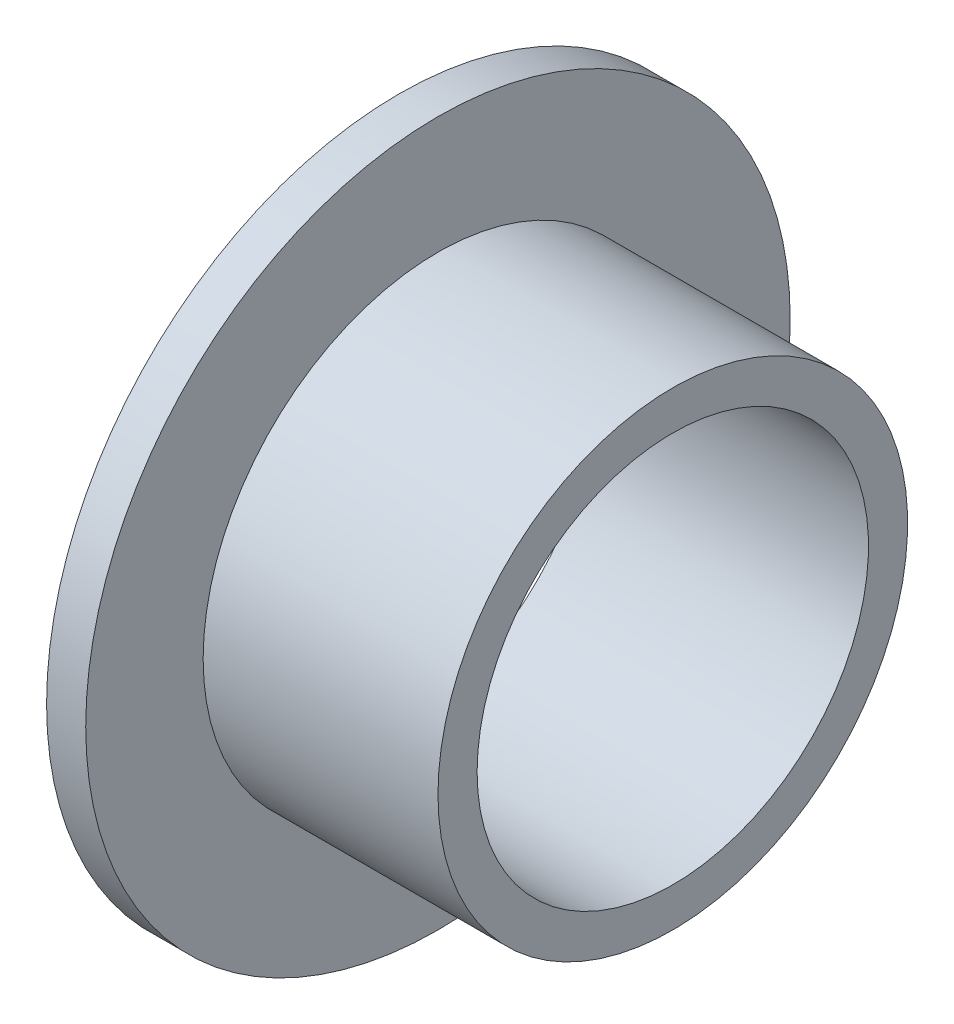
ISO-10303-21;
HEADER;
FILE_DESCRIPTION(('STEP AP214'),'2;1');
FILE_NAME('part.step','',(''),(''),'','','');
FILE_SCHEMA(('AUTOMOTIVE_DESIGN { 1 0 10303 214 1 1 1 1 }'));
ENDSEC;
DATA;
#1=APPLICATION_CONTEXT('core data for automotive mechanical design processes');
#2=APPLICATION_PROTOCOL_DEFINITION('international standard','automotive_design',2000,#1);
#3=PRODUCT_CONTEXT('',#1,'mechanical');
#4=PRODUCT('Part','Part','',(#3));
#5=PRODUCT_RELATED_PRODUCT_CATEGORY('part','',(#4));
#6=PRODUCT_DEFINITION_FORMATION('','',#4);
#7=PRODUCT_DEFINITION_CONTEXT('part definition',#1,'design');
#8=PRODUCT_DEFINITION('design','',#6,#7);
#9=PRODUCT_DEFINITION_SHAPE('','',#8);
#10=(LENGTH_UNIT() NAMED_UNIT(*) SI_UNIT(.MILLI.,.METRE.));
#11=(NAMED_UNIT(*) PLANE_ANGLE_UNIT() SI_UNIT($,.RADIAN.));
#12=(NAMED_UNIT(*) SI_UNIT($,.STERADIAN.) SOLID_ANGLE_UNIT());
#13=UNCERTAINTY_MEASURE_WITH_UNIT(LENGTH_MEASURE(1.E-05),#10,'distance_accuracy_value','');
#14=(GEOMETRIC_REPRESENTATION_CONTEXT(3) GLOBAL_UNCERTAINTY_ASSIGNED_CONTEXT((#13)) GLOBAL_UNIT_ASSIGNED_CONTEXT((#10,
#11,#12)) REPRESENTATION_CONTEXT('',''));
#15=CARTESIAN_POINT('',(0.,0.,0.));
#16=DIRECTION('',(0.,0.,1.));
#17=DIRECTION('',(1.,0.,0.));
#18=AXIS2_PLACEMENT_3D('',#15,#16,#17);
#19=CARTESIAN_POINT('',(-1000.,0.,0.));
#20=DIRECTION('',(-1.,0.,0.));
#21=DIRECTION('',(0.,0.,1.));
#22=AXIS2_PLACEMENT_3D('',#19,#20,#21);
#23=CYLINDRICAL_SURFACE('',#22,6.);
#24=CARTESIAN_POINT('',(0.99999999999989,0.,0.));
#25=DIRECTION('',(-1.,0.,0.));
#26=DIRECTION('',(0.,0.,1.));
#27=AXIS2_PLACEMENT_3D('',#24,#25,#26);
#28=CIRCLE('',#27,6.);
#29=CARTESIAN_POINT('',(0.99999999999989,0.,6.));
#30=VERTEX_POINT('',#29);
#31=EDGE_CURVE('E33',#30,#30,#28,.F.);
#32=ORIENTED_EDGE('',*,*,#31,.T.);
#33=EDGE_LOOP('',(#32));
#34=FACE_BOUND('',#33,.T.);
#35=CARTESIAN_POINT('',(6.9999999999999,0.,0.));
#36=DIRECTION('',(-1.,0.,0.));
#37=DIRECTION('',(0.,0.,1.));
#38=AXIS2_PLACEMENT_3D('',#35,#36,#37);
#39=CIRCLE('',#38,6.);
#40=CARTESIAN_POINT('',(6.9999999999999,0.,6.));
#41=VERTEX_POINT('',#40);
#42=EDGE_CURVE('E17',#41,#41,#39,.T.);
#43=ORIENTED_EDGE('',*,*,#42,.T.);
#44=EDGE_LOOP('',(#43));
#45=FACE_BOUND('',#44,.T.);
#46=ADVANCED_FACE('F14',(#34,#45),#23,.T.);
#47=CARTESIAN_POINT('',(7.,5.,0.));
#48=DIRECTION('',(-1.,0.,0.));
#49=DIRECTION('',(0.,0.,1.));
#50=AXIS2_PLACEMENT_3D('',#47,#48,#49);
#51=PLANE('',#50);
#52=CARTESIAN_POINT('',(6.9999999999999,0.,0.));
#53=DIRECTION('',(-1.,0.,0.));
#54=DIRECTION('',(0.,0.,1.));
#55=AXIS2_PLACEMENT_3D('',#52,#53,#54);
#56=CIRCLE('',#55,5.);
#57=CARTESIAN_POINT('',(6.9999999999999,0.,5.));
#58=VERTEX_POINT('',#57);
#59=EDGE_CURVE('E31',#58,#58,#56,.T.);
#60=ORIENTED_EDGE('',*,*,#59,.T.);
#61=EDGE_LOOP('',(#60));
#62=FACE_BOUND('',#61,.T.);
#63=ORIENTED_EDGE('',*,*,#42,.F.);
#64=EDGE_LOOP('',(#63));
#65=FACE_BOUND('',#64,.T.);
#66=ADVANCED_FACE('F41',(#62,#65),#51,.F.);
#67=CARTESIAN_POINT('',(1.,6.,0.));
#68=DIRECTION('',(-1.,0.,0.));
#69=DIRECTION('',(0.,0.,1.));
#70=AXIS2_PLACEMENT_3D('',#67,#68,#69);
#71=PLANE('',#70);
#72=ORIENTED_EDGE('',*,*,#31,.F.);
#73=EDGE_LOOP('',(#72));
#74=FACE_BOUND('',#73,.T.);
#75=CARTESIAN_POINT('',(0.99999999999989,0.,0.));
#76=DIRECTION('',(-1.,0.,0.));
#77=DIRECTION('',(0.,0.,1.));
#78=AXIS2_PLACEMENT_3D('',#75,#76,#77);
#79=CIRCLE('',#78,9.);
#80=CARTESIAN_POINT('',(0.99999999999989,0.,9.));
#81=VERTEX_POINT('',#80);
#82=EDGE_CURVE('E26',#81,#81,#79,.T.);
#83=ORIENTED_EDGE('',*,*,#82,.F.);
#84=EDGE_LOOP('',(#83));
#85=FACE_BOUND('',#84,.T.);
#86=ADVANCED_FACE('F43',(#74,#85),#71,.F.);
#87=CARTESIAN_POINT('',(-1000.,0.,0.));
#88=DIRECTION('',(-1.,0.,0.));
#89=DIRECTION('',(0.,0.,1.));
#90=AXIS2_PLACEMENT_3D('',#87,#88,#89);
#91=CYLINDRICAL_SURFACE('',#90,5.);
#92=ORIENTED_EDGE('',*,*,#59,.F.);
#93=EDGE_LOOP('',(#92));
#94=FACE_BOUND('',#93,.T.);
#95=CARTESIAN_POINT('',(0.,0.,0.));
#96=DIRECTION('',(-1.,0.,0.));
#97=DIRECTION('',(0.,0.,1.));
#98=AXIS2_PLACEMENT_3D('',#95,#96,#97);
#99=CIRCLE('',#98,5.);
#100=CARTESIAN_POINT('',(0.,0.,5.));
#101=VERTEX_POINT('',#100);
#102=EDGE_CURVE('E21',#101,#101,#99,.T.);
#103=ORIENTED_EDGE('',*,*,#102,.T.);
#104=EDGE_LOOP('',(#103));
#105=FACE_BOUND('',#104,.T.);
#106=ADVANCED_FACE('F50',(#94,#105),#91,.F.);
#107=CARTESIAN_POINT('',(-1000.,0.,0.));
#108=DIRECTION('',(-1.,0.,0.));
#109=DIRECTION('',(0.,0.,1.));
#110=AXIS2_PLACEMENT_3D('',#107,#108,#109);
#111=CYLINDRICAL_SURFACE('',#110,9.);
#112=CARTESIAN_POINT('',(0.,0.,0.));
#113=DIRECTION('',(-1.,0.,0.));
#114=DIRECTION('',(0.,0.,1.));
#115=AXIS2_PLACEMENT_3D('',#112,#113,#114);
#116=CIRCLE('',#115,9.);
#117=CARTESIAN_POINT('',(0.,0.,9.));
#118=VERTEX_POINT('',#117);
#119=EDGE_CURVE('E10',#118,#118,#116,.F.);
#120=ORIENTED_EDGE('',*,*,#119,.T.);
#121=EDGE_LOOP('',(#120));
#122=FACE_BOUND('',#121,.T.);
#123=ORIENTED_EDGE('',*,*,#82,.T.);
#124=EDGE_LOOP('',(#123));
#125=FACE_BOUND('',#124,.T.);
#126=ADVANCED_FACE('F55',(#122,#125),#111,.T.);
#127=CARTESIAN_POINT('',(0.,9.,0.));
#128=DIRECTION('',(1.,0.,0.));
#129=DIRECTION('',(0.,0.,-1.));
#130=AXIS2_PLACEMENT_3D('',#127,#128,#129);
#131=PLANE('',#130);
#132=ORIENTED_EDGE('',*,*,#119,.F.);
#133=EDGE_LOOP('',(#132));
#134=FACE_BOUND('',#133,.T.);
#135=ORIENTED_EDGE('',*,*,#102,.F.);
#136=EDGE_LOOP('',(#135));
#137=FACE_BOUND('',#136,.T.);
#138=ADVANCED_FACE('F53',(#134,#137),#131,.F.);
#139=CLOSED_SHELL('',(#46,#66,#86,#106,#126,#138));
#140=MANIFOLD_SOLID_BREP('B1',#139);
#141=ADVANCED_BREP_SHAPE_REPRESENTATION('',(#18,#140),#14);
#142=SHAPE_DEFINITION_REPRESENTATION(#9,#141);
ENDSEC;
END-ISO-10303-21;
